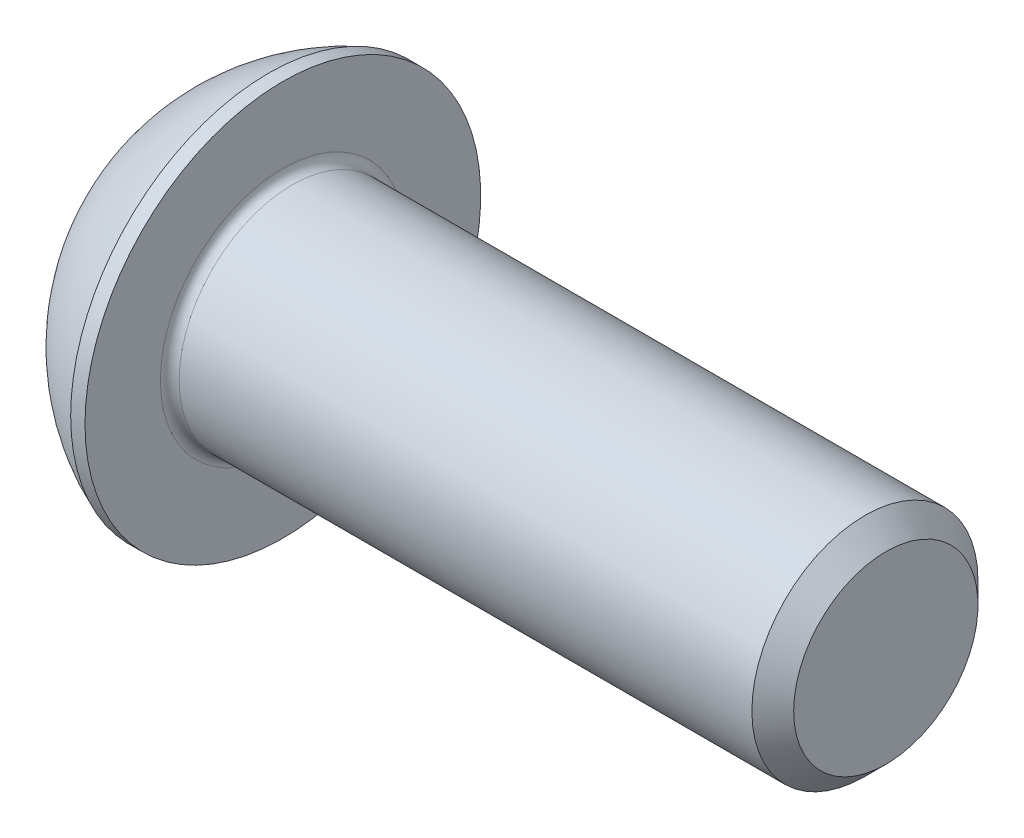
ISO-10303-21;
HEADER;
FILE_DESCRIPTION(('STEP AP214'),'2;1');
FILE_NAME('part.step','',(''),(''),'','','');
FILE_SCHEMA(('AUTOMOTIVE_DESIGN { 1 0 10303 214 1 1 1 1 }'));
ENDSEC;
DATA;
#1=APPLICATION_CONTEXT('core data for automotive mechanical design processes');
#2=APPLICATION_PROTOCOL_DEFINITION('international standard','automotive_design',2000,#1);
#3=PRODUCT_CONTEXT('',#1,'mechanical');
#4=PRODUCT('Part','Part','',(#3));
#5=PRODUCT_RELATED_PRODUCT_CATEGORY('part','',(#4));
#6=PRODUCT_DEFINITION_FORMATION('','',#4);
#7=PRODUCT_DEFINITION_CONTEXT('part definition',#1,'design');
#8=PRODUCT_DEFINITION('design','',#6,#7);
#9=PRODUCT_DEFINITION_SHAPE('','',#8);
#10=(LENGTH_UNIT() NAMED_UNIT(*) SI_UNIT(.MILLI.,.METRE.));
#11=(NAMED_UNIT(*) PLANE_ANGLE_UNIT() SI_UNIT($,.RADIAN.));
#12=(NAMED_UNIT(*) SI_UNIT($,.STERADIAN.) SOLID_ANGLE_UNIT());
#13=UNCERTAINTY_MEASURE_WITH_UNIT(LENGTH_MEASURE(1.E-05),#10,'distance_accuracy_value','');
#14=(GEOMETRIC_REPRESENTATION_CONTEXT(3) GLOBAL_UNCERTAINTY_ASSIGNED_CONTEXT((#13)) GLOBAL_UNIT_ASSIGNED_CONTEXT((#10,
#11,#12)) REPRESENTATION_CONTEXT('',''));
#15=CARTESIAN_POINT('',(0.,0.,0.));
#16=DIRECTION('',(0.,0.,1.));
#17=DIRECTION('',(1.,0.,0.));
#18=AXIS2_PLACEMENT_3D('',#15,#16,#17);
#19=CARTESIAN_POINT('',(0.,0.,0.));
#20=DIRECTION('',(-1.,0.,0.));
#21=DIRECTION('',(0.,0.,1.));
#22=AXIS2_PLACEMENT_3D('',#19,#20,#21);
#23=PLANE('',#22);
#24=CARTESIAN_POINT('',(0.,0.,0.));
#25=DIRECTION('',(-1.,0.,0.));
#26=DIRECTION('',(0.,0.,1.));
#27=AXIS2_PLACEMENT_3D('',#24,#25,#26);
#28=CIRCLE('',#27,2.625);
#29=CARTESIAN_POINT('',(0.,2.625,0.));
#30=VERTEX_POINT('',#29);
#31=EDGE_CURVE('E144',#30,#30,#28,.T.);
#32=ORIENTED_EDGE('',*,*,#31,.T.);
#33=EDGE_LOOP('',(#32));
#34=FACE_BOUND('',#33,.T.);
#35=DIRECTION('',(0.,0.5,-0.866025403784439));
#36=VECTOR('',#35,1.);
#37=CARTESIAN_POINT('',(0.,-1.15470053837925,-2.));
#38=LINE('',#37,#36);
#39=CARTESIAN_POINT('',(0.,-2.3094010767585,0.));
#40=VERTEX_POINT('',#39);
#41=CARTESIAN_POINT('',(0.,-1.15470053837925,-2.));
#42=VERTEX_POINT('',#41);
#43=EDGE_CURVE('E102',#40,#42,#38,.T.);
#44=ORIENTED_EDGE('',*,*,#43,.T.);
#45=DIRECTION('',(0.,1.,0.));
#46=VECTOR('',#45,1.);
#47=CARTESIAN_POINT('',(0.,1.15470053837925,-2.));
#48=LINE('',#47,#46);
#49=CARTESIAN_POINT('',(0.,1.15470053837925,-2.));
#50=VERTEX_POINT('',#49);
#51=EDGE_CURVE('E114',#42,#50,#48,.T.);
#52=ORIENTED_EDGE('',*,*,#51,.T.);
#53=DIRECTION('',(0.,0.5,0.866025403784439));
#54=VECTOR('',#53,1.);
#55=CARTESIAN_POINT('',(0.,2.3094010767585,0.));
#56=LINE('',#55,#54);
#57=CARTESIAN_POINT('',(0.,2.3094010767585,0.));
#58=VERTEX_POINT('',#57);
#59=EDGE_CURVE('E380',#50,#58,#56,.T.);
#60=ORIENTED_EDGE('',*,*,#59,.T.);
#61=DIRECTION('',(0.,-0.5,0.866025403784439));
#62=VECTOR('',#61,1.);
#63=CARTESIAN_POINT('',(0.,1.15470053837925,2.));
#64=LINE('',#63,#62);
#65=CARTESIAN_POINT('',(0.,1.15470053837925,2.));
#66=VERTEX_POINT('',#65);
#67=EDGE_CURVE('E383',#58,#66,#64,.T.);
#68=ORIENTED_EDGE('',*,*,#67,.T.);
#69=DIRECTION('',(0.,-1.,0.));
#70=VECTOR('',#69,1.);
#71=CARTESIAN_POINT('',(0.,-1.15470053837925,2.));
#72=LINE('',#71,#70);
#73=CARTESIAN_POINT('',(0.,-1.15470053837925,2.));
#74=VERTEX_POINT('',#73);
#75=EDGE_CURVE('E43',#66,#74,#72,.T.);
#76=ORIENTED_EDGE('',*,*,#75,.T.);
#77=DIRECTION('',(0.,-0.5,-0.866025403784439));
#78=VECTOR('',#77,1.);
#79=CARTESIAN_POINT('',(0.,-2.3094010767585,0.));
#80=LINE('',#79,#78);
#81=EDGE_CURVE('E100',#74,#40,#80,.T.);
#82=ORIENTED_EDGE('',*,*,#81,.T.);
#83=EDGE_LOOP('',(#44,#52,#60,#68,#76,#82));
#84=FACE_BOUND('',#83,.T.);
#85=ADVANCED_FACE('F29',(#34,#84),#23,.T.);
#86=CARTESIAN_POINT('',(4.99970462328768,0.,0.));
#87=DIRECTION('',(-1.,0.,0.));
#88=DIRECTION('',(0.,1.,0.));
#89=AXIS2_PLACEMENT_3D('',#86,#87,#88);
#90=SPHERICAL_SURFACE('',#89,5.64691697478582);
#91=CARTESIAN_POINT('',(2.92,0.,0.));
#92=DIRECTION('',(-1.,0.,0.));
#93=DIRECTION('',(0.,0.,1.));
#94=AXIS2_PLACEMENT_3D('',#91,#92,#93);
#95=CIRCLE('',#94,5.25);
#96=CARTESIAN_POINT('',(2.92,5.25,0.));
#97=VERTEX_POINT('',#96);
#98=EDGE_CURVE('E141',#97,#97,#95,.T.);
#99=CARTESIAN_POINT('',(2.92,5.25,0.));
#100=CARTESIAN_POINT('',(2.88116333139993,5.23461555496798,0.));
#101=CARTESIAN_POINT('',(2.84249743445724,5.21880002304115,0.));
#102=CARTESIAN_POINT('',(2.76552608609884,5.18631490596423,0.));
#103=CARTESIAN_POINT('',(2.72722063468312,5.16964532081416,0.));
#104=CARTESIAN_POINT('',(2.65098907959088,5.13546021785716,0.));
#105=CARTESIAN_POINT('',(2.61306297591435,5.11794470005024,0.));
#106=CARTESIAN_POINT('',(2.5376087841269,5.08207638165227,0.));
#107=CARTESIAN_POINT('',(2.50008069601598,5.06372358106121,0.));
#108=CARTESIAN_POINT('',(2.42544101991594,5.02618972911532,0.));
#109=CARTESIAN_POINT('',(2.38832943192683,5.00700867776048,0.));
#110=CARTESIAN_POINT('',(2.31454103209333,4.9678277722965,0.));
#111=CARTESIAN_POINT('',(2.27786422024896,4.94782791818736,0.));
#112=CARTESIAN_POINT('',(2.204963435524,4.90701925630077,0.));
#113=CARTESIAN_POINT('',(2.16873946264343,4.88621044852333,0.));
#114=CARTESIAN_POINT('',(2.09676219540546,4.84379412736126,0.));
#115=CARTESIAN_POINT('',(2.06100890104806,4.82218661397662,0.));
#116=CARTESIAN_POINT('',(1.9899905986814,4.77818352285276,0.));
#117=CARTESIAN_POINT('',(1.95472559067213,4.75578794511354,0.));
#118=CARTESIAN_POINT('',(1.88470122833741,4.71021975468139,0.));
#119=CARTESIAN_POINT('',(1.84994187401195,4.68704714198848,0.));
#120=CARTESIAN_POINT('',(1.78094593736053,4.63993629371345,0.));
#121=CARTESIAN_POINT('',(1.74670935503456,4.61599805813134,0.));
#122=CARTESIAN_POINT('',(1.67877582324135,4.56736775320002,0.));
#123=CARTESIAN_POINT('',(1.6450788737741,4.54267568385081,0.));
#124=CARTESIAN_POINT('',(1.57824120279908,4.4925498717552,0.));
#125=CARTESIAN_POINT('',(1.54510048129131,4.4671161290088,0.));
#126=CARTESIAN_POINT('',(1.47939158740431,4.4155194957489,0.));
#127=CARTESIAN_POINT('',(1.44682341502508,4.38935660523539,0.));
#128=CARTESIAN_POINT('',(1.3822756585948,4.33631456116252,0.));
#129=CARTESIAN_POINT('',(1.35029607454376,4.30943540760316,0.));
#130=CARTESIAN_POINT('',(1.28694124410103,4.2549740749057,0.));
#131=CARTESIAN_POINT('',(1.25556599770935,4.22739189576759,0.));
#132=CARTESIAN_POINT('',(1.19343529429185,4.17153809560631,0.));
#133=CARTESIAN_POINT('',(1.16267983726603,4.14326647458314,0.));
#134=CARTESIAN_POINT('',(1.10180385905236,4.0860477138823,0.));
#135=CARTESIAN_POINT('',(1.07168333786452,4.05710057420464,0.));
#136=CARTESIAN_POINT('',(1.01209206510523,3.99854503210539,0.));
#137=CARTESIAN_POINT('',(0.98262131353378,3.96893662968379,0.));
#138=CARTESIAN_POINT('',(0.924344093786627,3.90907314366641,0.));
#139=CARTESIAN_POINT('',(0.89553762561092,3.87881806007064,0.));
#140=CARTESIAN_POINT('',(0.838603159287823,3.8176761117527,0.));
#141=CARTESIAN_POINT('',(0.810475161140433,3.78678924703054,0.));
#142=CARTESIAN_POINT('',(0.754911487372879,3.72439894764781,0.));
#143=CARTESIAN_POINT('',(0.727475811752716,3.69289551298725,0.));
#144=CARTESIAN_POINT('',(0.673310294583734,3.62928758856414,0.));
#145=CARTESIAN_POINT('',(0.646580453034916,3.59718309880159,0.));
#146=CARTESIAN_POINT('',(0.593839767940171,3.53238887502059,0.));
#147=CARTESIAN_POINT('',(0.567828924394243,3.49969914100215,0.));
#148=CARTESIAN_POINT('',(0.516539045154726,3.43375052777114,0.));
#149=CARTESIAN_POINT('',(0.491260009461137,3.40049164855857,0.));
#150=CARTESIAN_POINT('',(0.441446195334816,3.33342112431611,0.));
#151=CARTESIAN_POINT('',(0.416911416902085,3.29960947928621,0.));
#152=CARTESIAN_POINT('',(0.368598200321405,3.23145007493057,0.));
#153=CARTESIAN_POINT('',(0.344819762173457,3.19710231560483,0.));
#154=CARTESIAN_POINT('',(0.298030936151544,3.12788759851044,0.));
#155=CARTESIAN_POINT('',(0.275020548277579,3.0930206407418,0.));
#156=CARTESIAN_POINT('',(0.229779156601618,3.02278469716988,0.));
#157=CARTESIAN_POINT('',(0.207548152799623,2.98741571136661,0.));
#158=CARTESIAN_POINT('',(0.163876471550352,2.91619313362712,0.));
#159=CARTESIAN_POINT('',(0.142435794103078,2.8803395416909,0.));
#160=CARTESIAN_POINT('',(0.100355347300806,2.80816539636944,0.));
#161=CARTESIAN_POINT('',(0.079715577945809,2.7718448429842,0.));
#162=CARTESIAN_POINT('',(0.0392470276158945,2.69875470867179,0.));
#163=CARTESIAN_POINT('',(0.0194182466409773,2.66198512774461,0.));
#164=CARTESIAN_POINT('',(0.,2.625,0.));
#165=B_SPLINE_CURVE_WITH_KNOTS('',3,(#99,#100,#101,#102,#103,#104,#105,#106,#107,#108,#109,#110,
#111,#112,#113,#114,#115,#116,#117,#118,#119,#120,#121,#122,#123,#124,#125,#126,#127,#128,#129,
#130,#131,#132,#133,#134,#135,#136,#137,#138,#139,#140,#141,#142,#143,#144,#145,#146,#147,#148,
#149,#150,#151,#152,#153,#154,#155,#156,#157,#158,#159,#160,#161,#162,#163,#164),.UNSPECIFIED.,
.F.,.F.,(4,2,2,2,2,2,2,2,2,2,2,2,2,2,2,2,2,2,2,2,2,2,2,2,2,2,2,2,2,2,2,2,4),(0.,
0.12531586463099,0.250631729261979,0.375947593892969,0.501263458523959,0.626579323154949,
0.751895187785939,0.877211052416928,1.00252691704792,1.12784278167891,1.2531586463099,
1.37847451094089,1.50379037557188,1.62910624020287,1.75442210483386,1.87973796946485,
2.00505383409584,2.13036969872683,2.25568556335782,2.38100142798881,2.5063172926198,
2.63163315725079,2.75694902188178,2.88226488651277,3.00758075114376,3.13289661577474,
3.25821248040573,3.38352834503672,3.50884420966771,3.6341600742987,3.75947593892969,
3.88479180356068,4.01010766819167),.UNSPECIFIED.);
#166=EDGE_CURVE('BSEAM168',#97,#30,#165,.T.);
#167=ORIENTED_EDGE('',*,*,#98,.T.);
#168=ORIENTED_EDGE('',*,*,#31,.F.);
#169=ORIENTED_EDGE('',*,*,#166,.T.);
#170=ORIENTED_EDGE('',*,*,#166,.F.);
#171=EDGE_LOOP('',(#167,#169,#168,#170));
#172=FACE_BOUND('',#171,.T.);
#173=ADVANCED_FACE('F168',(#172),#90,.T.);
#174=CARTESIAN_POINT('',(0.,0.,0.));
#175=DIRECTION('',(-1.,0.,0.));
#176=DIRECTION('',(0.,0.,1.));
#177=AXIS2_PLACEMENT_3D('',#174,#175,#176);
#178=CYLINDRICAL_SURFACE('',#177,5.25);
#179=ORIENTED_EDGE('',*,*,#98,.F.);
#180=EDGE_LOOP('',(#179));
#181=FACE_BOUND('',#180,.T.);
#182=CARTESIAN_POINT('',(3.3,0.,0.));
#183=DIRECTION('',(-1.,0.,0.));
#184=DIRECTION('',(0.,0.,1.));
#185=AXIS2_PLACEMENT_3D('',#182,#183,#184);
#186=CIRCLE('',#185,5.25);
#187=CARTESIAN_POINT('',(3.3,0.,5.25));
#188=VERTEX_POINT('',#187);
#189=EDGE_CURVE('E138',#188,#188,#186,.T.);
#190=ORIENTED_EDGE('',*,*,#189,.T.);
#191=EDGE_LOOP('',(#190));
#192=FACE_BOUND('',#191,.T.);
#193=ADVANCED_FACE('F173',(#181,#192),#178,.T.);
#194=CARTESIAN_POINT('',(3.3,2.99999999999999,0.));
#195=DIRECTION('',(-1.,0.,0.));
#196=DIRECTION('',(0.,0.,1.));
#197=AXIS2_PLACEMENT_3D('',#194,#195,#196);
#198=PLANE('',#197);
#199=CARTESIAN_POINT('',(3.3,0.,0.));
#200=DIRECTION('',(-1.,0.,0.));
#201=DIRECTION('',(0.,0.,1.));
#202=AXIS2_PLACEMENT_3D('',#199,#200,#201);
#203=CIRCLE('',#202,3.24999999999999);
#204=CARTESIAN_POINT('',(3.3,0.,3.24999999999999));
#205=VERTEX_POINT('',#204);
#206=EDGE_CURVE('E36',#205,#205,#203,.T.);
#207=ORIENTED_EDGE('',*,*,#206,.T.);
#208=EDGE_LOOP('',(#207));
#209=FACE_BOUND('',#208,.T.);
#210=ORIENTED_EDGE('',*,*,#189,.F.);
#211=EDGE_LOOP('',(#210));
#212=FACE_BOUND('',#211,.T.);
#213=ADVANCED_FACE('F149',(#209,#212),#198,.F.);
#214=CARTESIAN_POINT('',(0.,0.,0.));
#215=DIRECTION('',(-1.,0.,0.));
#216=DIRECTION('',(0.,0.,1.));
#217=AXIS2_PLACEMENT_3D('',#214,#215,#216);
#218=CYLINDRICAL_SURFACE('',#217,2.99999999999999);
#219=CARTESIAN_POINT('',(3.55,0.,0.));
#220=DIRECTION('',(-1.,0.,0.));
#221=DIRECTION('',(0.,0.,1.));
#222=AXIS2_PLACEMENT_3D('',#219,#220,#221);
#223=CIRCLE('',#222,2.99999999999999);
#224=CARTESIAN_POINT('',(3.55,0.,2.99999999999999));
#225=VERTEX_POINT('',#224);
#226=EDGE_CURVE('E11',#225,#225,#223,.F.);
#227=ORIENTED_EDGE('',*,*,#226,.T.);
#228=EDGE_LOOP('',(#227));
#229=FACE_BOUND('',#228,.T.);
#230=CARTESIAN_POINT('',(18.7455,0.,0.));
#231=DIRECTION('',(-1.,0.,0.));
#232=DIRECTION('',(0.,0.,1.));
#233=AXIS2_PLACEMENT_3D('',#230,#231,#232);
#234=CIRCLE('',#233,2.99999999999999);
#235=CARTESIAN_POINT('',(18.7455,0.,2.99999999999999));
#236=VERTEX_POINT('',#235);
#237=EDGE_CURVE('E135',#236,#236,#234,.T.);
#238=ORIENTED_EDGE('',*,*,#237,.T.);
#239=EDGE_LOOP('',(#238));
#240=FACE_BOUND('',#239,.T.);
#241=ADVANCED_FACE('F185',(#229,#240),#218,.T.);
#242=CARTESIAN_POINT('',(19.3,0.,0.));
#243=DIRECTION('',(-1.,0.,0.));
#244=DIRECTION('',(0.,0.,1.));
#245=AXIS2_PLACEMENT_3D('',#242,#243,#244);
#246=CONICAL_SURFACE('',#245,2.4455,0.785398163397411);
#247=ORIENTED_EDGE('',*,*,#237,.F.);
#248=EDGE_LOOP('',(#247));
#249=FACE_BOUND('',#248,.T.);
#250=CARTESIAN_POINT('',(19.3,0.,0.));
#251=DIRECTION('',(-1.,0.,0.));
#252=DIRECTION('',(0.,0.,1.));
#253=AXIS2_PLACEMENT_3D('',#250,#251,#252);
#254=CIRCLE('',#253,2.4455);
#255=CARTESIAN_POINT('',(19.3,0.,2.4455));
#256=VERTEX_POINT('',#255);
#257=EDGE_CURVE('E131',#256,#256,#254,.T.);
#258=ORIENTED_EDGE('',*,*,#257,.T.);
#259=EDGE_LOOP('',(#258));
#260=FACE_BOUND('',#259,.T.);
#261=ADVANCED_FACE('F162',(#249,#260),#246,.T.);
#262=CARTESIAN_POINT('',(19.3,0.,0.));
#263=DIRECTION('',(-1.,0.,0.));
#264=DIRECTION('',(0.,0.,1.));
#265=AXIS2_PLACEMENT_3D('',#262,#263,#264);
#266=PLANE('',#265);
#267=ORIENTED_EDGE('',*,*,#257,.F.);
#268=EDGE_LOOP('',(#267));
#269=FACE_BOUND('',#268,.T.);
#270=ADVANCED_FACE('F154',(#269),#266,.F.);
#271=CARTESIAN_POINT('',(3.55,0.,0.));
#272=DIRECTION('',(-1.,0.,0.));
#273=DIRECTION('',(0.,0.,1.));
#274=AXIS2_PLACEMENT_3D('',#271,#272,#273);
#275=TOROIDAL_SURFACE('',#274,3.24999999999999,0.25);
#276=ORIENTED_EDGE('',*,*,#226,.F.);
#277=EDGE_LOOP('',(#276));
#278=FACE_BOUND('',#277,.T.);
#279=ORIENTED_EDGE('',*,*,#206,.F.);
#280=EDGE_LOOP('',(#279));
#281=FACE_BOUND('',#280,.T.);
#282=ADVANCED_FACE('F152',(#278,#281),#275,.F.);
#283=CARTESIAN_POINT('',(2.08,-2.3094010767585,0.));
#284=DIRECTION('',(0.,0.866025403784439,-0.5));
#285=DIRECTION('',(0.,0.5,0.866025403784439));
#286=AXIS2_PLACEMENT_3D('',#283,#284,#285);
#287=PLANE('',#286);
#288=DIRECTION('',(0.,-0.5,-0.866025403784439));
#289=VECTOR('',#288,1.);
#290=CARTESIAN_POINT('',(2.08,-2.3094010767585,0.));
#291=LINE('',#290,#289);
#292=CARTESIAN_POINT('',(2.08,-1.15470053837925,2.));
#293=VERTEX_POINT('',#292);
#294=CARTESIAN_POINT('',(2.08,-1.73205080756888,1.));
#295=VERTEX_POINT('',#294);
#296=EDGE_CURVE('E358',#293,#295,#291,.T.);
#297=ORIENTED_EDGE('',*,*,#296,.T.);
#298=CARTESIAN_POINT('',(2.08,-2.3094010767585,0.));
#299=VERTEX_POINT('',#298);
#300=EDGE_CURVE('E119',#295,#299,#291,.T.);
#301=ORIENTED_EDGE('',*,*,#300,.T.);
#302=DIRECTION('',(-1.,0.,0.));
#303=VECTOR('',#302,1.);
#304=CARTESIAN_POINT('',(2.08,-2.3094010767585,0.));
#305=LINE('',#304,#303);
#306=EDGE_CURVE('E110',#299,#40,#305,.T.);
#307=ORIENTED_EDGE('',*,*,#306,.T.);
#308=ORIENTED_EDGE('',*,*,#81,.F.);
#309=DIRECTION('',(-1.,0.,0.));
#310=VECTOR('',#309,1.);
#311=CARTESIAN_POINT('',(2.08,-1.15470053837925,2.));
#312=LINE('',#311,#310);
#313=EDGE_CURVE('E364',#293,#74,#312,.T.);
#314=ORIENTED_EDGE('',*,*,#313,.F.);
#315=EDGE_LOOP('',(#297,#301,#307,#308,#314));
#316=FACE_BOUND('',#315,.T.);
#317=ADVANCED_FACE('F117',(#316),#287,.T.);
#318=CARTESIAN_POINT('',(2.08,-1.15470053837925,-2.));
#319=DIRECTION('',(0.,0.866025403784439,0.5));
#320=DIRECTION('',(0.,-0.5,0.866025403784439));
#321=AXIS2_PLACEMENT_3D('',#318,#319,#320);
#322=PLANE('',#321);
#323=DIRECTION('',(0.,0.5,-0.866025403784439));
#324=VECTOR('',#323,1.);
#325=CARTESIAN_POINT('',(2.08,-1.15470053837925,-2.));
#326=LINE('',#325,#324);
#327=CARTESIAN_POINT('',(2.08,-1.73205080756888,-1.));
#328=VERTEX_POINT('',#327);
#329=EDGE_CURVE('E51',#299,#328,#326,.T.);
#330=ORIENTED_EDGE('',*,*,#329,.T.);
#331=CARTESIAN_POINT('',(2.08,-1.15470053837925,-2.));
#332=VERTEX_POINT('',#331);
#333=EDGE_CURVE('E390',#328,#332,#326,.T.);
#334=ORIENTED_EDGE('',*,*,#333,.T.);
#335=DIRECTION('',(-1.,0.,0.));
#336=VECTOR('',#335,1.);
#337=CARTESIAN_POINT('',(2.08,-1.15470053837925,-2.));
#338=LINE('',#337,#336);
#339=EDGE_CURVE('E112',#332,#42,#338,.T.);
#340=ORIENTED_EDGE('',*,*,#339,.T.);
#341=ORIENTED_EDGE('',*,*,#43,.F.);
#342=ORIENTED_EDGE('',*,*,#306,.F.);
#343=EDGE_LOOP('',(#330,#334,#340,#341,#342));
#344=FACE_BOUND('',#343,.T.);
#345=ADVANCED_FACE('F109',(#344),#322,.T.);
#346=CARTESIAN_POINT('',(2.08,1.15470053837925,-2.));
#347=DIRECTION('',(0.,0.,1.));
#348=DIRECTION('',(0.,-1.,0.));
#349=AXIS2_PLACEMENT_3D('',#346,#347,#348);
#350=PLANE('',#349);
#351=DIRECTION('',(0.,1.,0.));
#352=VECTOR('',#351,1.);
#353=CARTESIAN_POINT('',(2.08,1.15470053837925,-2.));
#354=LINE('',#353,#352);
#355=CARTESIAN_POINT('',(2.08,0.,-2.));
#356=VERTEX_POINT('',#355);
#357=EDGE_CURVE('E392',#332,#356,#354,.T.);
#358=ORIENTED_EDGE('',*,*,#357,.T.);
#359=CARTESIAN_POINT('',(2.08,1.15470053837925,-2.));
#360=VERTEX_POINT('',#359);
#361=EDGE_CURVE('E377',#356,#360,#354,.T.);
#362=ORIENTED_EDGE('',*,*,#361,.T.);
#363=DIRECTION('',(-1.,0.,0.));
#364=VECTOR('',#363,1.);
#365=CARTESIAN_POINT('',(2.08,1.15470053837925,-2.));
#366=LINE('',#365,#364);
#367=EDGE_CURVE('E126',#360,#50,#366,.T.);
#368=ORIENTED_EDGE('',*,*,#367,.T.);
#369=ORIENTED_EDGE('',*,*,#51,.F.);
#370=ORIENTED_EDGE('',*,*,#339,.F.);
#371=EDGE_LOOP('',(#358,#362,#368,#369,#370));
#372=FACE_BOUND('',#371,.T.);
#373=ADVANCED_FACE('F239',(#372),#350,.T.);
#374=CARTESIAN_POINT('',(2.08,2.3094010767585,0.));
#375=DIRECTION('',(0.,-0.866025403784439,0.5));
#376=DIRECTION('',(0.,-0.5,-0.866025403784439));
#377=AXIS2_PLACEMENT_3D('',#374,#375,#376);
#378=PLANE('',#377);
#379=DIRECTION('',(0.,0.5,0.866025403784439));
#380=VECTOR('',#379,1.);
#381=CARTESIAN_POINT('',(2.08,2.3094010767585,0.));
#382=LINE('',#381,#380);
#383=CARTESIAN_POINT('',(2.08,1.73205080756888,-1.));
#384=VERTEX_POINT('',#383);
#385=EDGE_CURVE('E394',#360,#384,#382,.T.);
#386=ORIENTED_EDGE('',*,*,#385,.T.);
#387=CARTESIAN_POINT('',(2.08,2.3094010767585,0.));
#388=VERTEX_POINT('',#387);
#389=EDGE_CURVE('E393',#384,#388,#382,.T.);
#390=ORIENTED_EDGE('',*,*,#389,.T.);
#391=DIRECTION('',(-1.,0.,0.));
#392=VECTOR('',#391,1.);
#393=CARTESIAN_POINT('',(2.08,2.3094010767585,0.));
#394=LINE('',#393,#392);
#395=EDGE_CURVE('E370',#388,#58,#394,.T.);
#396=ORIENTED_EDGE('',*,*,#395,.T.);
#397=ORIENTED_EDGE('',*,*,#59,.F.);
#398=ORIENTED_EDGE('',*,*,#367,.F.);
#399=EDGE_LOOP('',(#386,#390,#396,#397,#398));
#400=FACE_BOUND('',#399,.T.);
#401=ADVANCED_FACE('F248',(#400),#378,.T.);
#402=CARTESIAN_POINT('',(2.08,1.15470053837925,2.));
#403=DIRECTION('',(0.,-0.866025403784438,-0.5));
#404=DIRECTION('',(0.,0.5,-0.866025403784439));
#405=AXIS2_PLACEMENT_3D('',#402,#403,#404);
#406=PLANE('',#405);
#407=DIRECTION('',(0.,-0.5,0.866025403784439));
#408=VECTOR('',#407,1.);
#409=CARTESIAN_POINT('',(2.08,1.15470053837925,2.));
#410=LINE('',#409,#408);
#411=CARTESIAN_POINT('',(2.08,1.73205080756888,1.));
#412=VERTEX_POINT('',#411);
#413=EDGE_CURVE('E359',#388,#412,#410,.T.);
#414=ORIENTED_EDGE('',*,*,#413,.T.);
#415=CARTESIAN_POINT('',(2.08,1.15470053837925,2.));
#416=VERTEX_POINT('',#415);
#417=EDGE_CURVE('E354',#412,#416,#410,.T.);
#418=ORIENTED_EDGE('',*,*,#417,.T.);
#419=DIRECTION('',(-1.,0.,0.));
#420=VECTOR('',#419,1.);
#421=CARTESIAN_POINT('',(2.08,1.15470053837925,2.));
#422=LINE('',#421,#420);
#423=EDGE_CURVE('E363',#416,#66,#422,.T.);
#424=ORIENTED_EDGE('',*,*,#423,.T.);
#425=ORIENTED_EDGE('',*,*,#67,.F.);
#426=ORIENTED_EDGE('',*,*,#395,.F.);
#427=EDGE_LOOP('',(#414,#418,#424,#425,#426));
#428=FACE_BOUND('',#427,.T.);
#429=ADVANCED_FACE('F258',(#428),#406,.T.);
#430=CARTESIAN_POINT('',(2.08,-3.46410161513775,-2.));
#431=DIRECTION('',(1.,0.,0.));
#432=DIRECTION('',(0.,0.,-1.));
#433=AXIS2_PLACEMENT_3D('',#430,#431,#432);
#434=PLANE('',#433);
#435=CARTESIAN_POINT('',(2.08,0.,0.));
#436=DIRECTION('',(-1.,0.,0.));
#437=DIRECTION('',(0.,0.,1.));
#438=AXIS2_PLACEMENT_3D('',#435,#436,#437);
#439=CIRCLE('',#438,2.);
#440=EDGE_CURVE('E397',#384,#356,#439,.T.);
#441=ORIENTED_EDGE('',*,*,#440,.F.);
#442=ORIENTED_EDGE('',*,*,#385,.F.);
#443=ORIENTED_EDGE('',*,*,#361,.F.);
#444=EDGE_LOOP('',(#441,#442,#443));
#445=FACE_BOUND('',#444,.T.);
#446=ADVANCED_FACE('F268',(#445),#434,.F.);
#447=EDGE_CURVE('E132',#412,#384,#439,.T.);
#448=ORIENTED_EDGE('',*,*,#447,.F.);
#449=ORIENTED_EDGE('',*,*,#413,.F.);
#450=ORIENTED_EDGE('',*,*,#389,.F.);
#451=EDGE_LOOP('',(#448,#449,#450));
#452=FACE_BOUND('',#451,.T.);
#453=ADVANCED_FACE('F278',(#452),#434,.F.);
#454=CARTESIAN_POINT('',(2.08,0.,2.));
#455=VERTEX_POINT('',#454);
#456=EDGE_CURVE('E125',#455,#412,#439,.T.);
#457=ORIENTED_EDGE('',*,*,#456,.F.);
#458=DIRECTION('',(0.,-1.,0.));
#459=VECTOR('',#458,1.);
#460=CARTESIAN_POINT('',(2.08,-1.15470053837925,2.));
#461=LINE('',#460,#459);
#462=EDGE_CURVE('E353',#416,#455,#461,.T.);
#463=ORIENTED_EDGE('',*,*,#462,.F.);
#464=ORIENTED_EDGE('',*,*,#417,.F.);
#465=EDGE_LOOP('',(#457,#463,#464));
#466=FACE_BOUND('',#465,.T.);
#467=ADVANCED_FACE('F289',(#466),#434,.F.);
#468=EDGE_CURVE('E120',#295,#455,#439,.T.);
#469=ORIENTED_EDGE('',*,*,#468,.F.);
#470=ORIENTED_EDGE('',*,*,#296,.F.);
#471=EDGE_CURVE('E357',#455,#293,#461,.T.);
#472=ORIENTED_EDGE('',*,*,#471,.F.);
#473=EDGE_LOOP('',(#469,#470,#472));
#474=FACE_BOUND('',#473,.T.);
#475=ADVANCED_FACE('F298',(#474),#434,.F.);
#476=EDGE_CURVE('E123',#328,#295,#439,.T.);
#477=ORIENTED_EDGE('',*,*,#476,.F.);
#478=ORIENTED_EDGE('',*,*,#329,.F.);
#479=ORIENTED_EDGE('',*,*,#300,.F.);
#480=EDGE_LOOP('',(#477,#478,#479));
#481=FACE_BOUND('',#480,.T.);
#482=ADVANCED_FACE('F307',(#481),#434,.F.);
#483=CARTESIAN_POINT('',(2.08,-1.15470053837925,2.));
#484=DIRECTION('',(0.,0.,-1.));
#485=DIRECTION('',(0.,1.,0.));
#486=AXIS2_PLACEMENT_3D('',#483,#484,#485);
#487=PLANE('',#486);
#488=ORIENTED_EDGE('',*,*,#462,.T.);
#489=ORIENTED_EDGE('',*,*,#471,.T.);
#490=ORIENTED_EDGE('',*,*,#313,.T.);
#491=ORIENTED_EDGE('',*,*,#75,.F.);
#492=ORIENTED_EDGE('',*,*,#423,.F.);
#493=EDGE_LOOP('',(#488,#489,#490,#491,#492));
#494=FACE_BOUND('',#493,.T.);
#495=ADVANCED_FACE('F316',(#494),#487,.T.);
#496=EDGE_CURVE('E398',#356,#328,#439,.T.);
#497=ORIENTED_EDGE('',*,*,#496,.F.);
#498=ORIENTED_EDGE('',*,*,#357,.F.);
#499=ORIENTED_EDGE('',*,*,#333,.F.);
#500=EDGE_LOOP('',(#497,#498,#499));
#501=FACE_BOUND('',#500,.T.);
#502=ADVANCED_FACE('F281',(#501),#434,.F.);
#503=CARTESIAN_POINT('',(3.23470053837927,0.,0.));
#504=DIRECTION('',(-1.,0.,0.));
#505=DIRECTION('',(0.,0.,1.));
#506=AXIS2_PLACEMENT_3D('',#503,#504,#505);
#507=CONICAL_SURFACE('',#506,0.,1.04719755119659);
#508=ORIENTED_EDGE('',*,*,#456,.T.);
#509=ORIENTED_EDGE('',*,*,#447,.T.);
#510=ORIENTED_EDGE('',*,*,#440,.T.);
#511=ORIENTED_EDGE('',*,*,#496,.T.);
#512=ORIENTED_EDGE('',*,*,#476,.T.);
#513=ORIENTED_EDGE('',*,*,#468,.T.);
#514=EDGE_LOOP('',(#508,#509,#510,#511,#512,#513));
#515=FACE_BOUND('',#514,.T.);
#516=CARTESIAN_POINT('',(3.23470053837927,0.,0.));
#517=VERTEX_POINT('',#516);
#518=VERTEX_LOOP('',#517);
#519=FACE_BOUND('',#518,.T.);
#520=ADVANCED_FACE('F334',(#515,#519),#507,.F.);
#521=CLOSED_SHELL('',(#85,#173,#193,#213,#241,#261,#270,#282,#317,#345,#373,#401,#429,#446,#453,
#467,#475,#482,#495,#502,#520));
#522=MANIFOLD_SOLID_BREP('B2',#521);
#523=ADVANCED_BREP_SHAPE_REPRESENTATION('',(#18,#522),#14);
#524=SHAPE_DEFINITION_REPRESENTATION(#9,#523);
ENDSEC;
END-ISO-10303-21;
